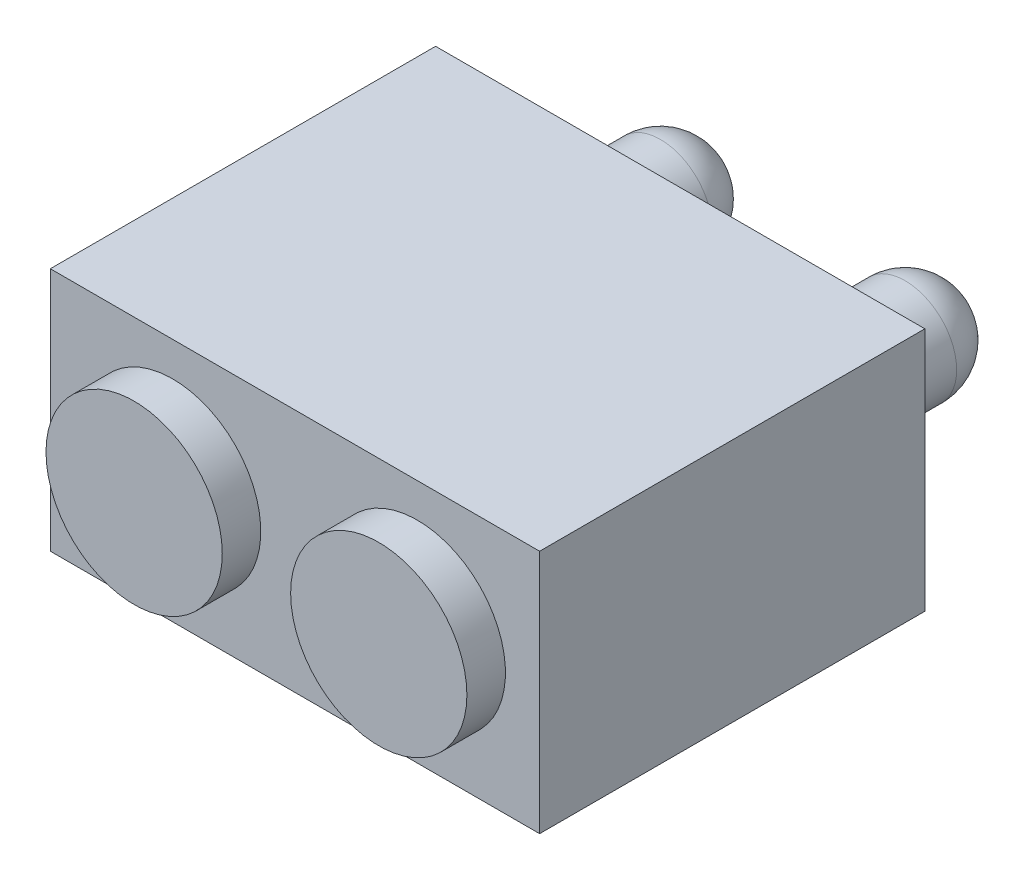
ISO-10303-21;
HEADER;
FILE_DESCRIPTION(('STEP AP214'),'2;1');
FILE_NAME('part.step','',(''),(''),'','','');
FILE_SCHEMA(('AUTOMOTIVE_DESIGN { 1 0 10303 214 1 1 1 1 }'));
ENDSEC;
DATA;
#1=APPLICATION_CONTEXT('core data for automotive mechanical design processes');
#2=APPLICATION_PROTOCOL_DEFINITION('international standard','automotive_design',2000,#1);
#3=PRODUCT_CONTEXT('',#1,'mechanical');
#4=PRODUCT('Part','Part','',(#3));
#5=PRODUCT_RELATED_PRODUCT_CATEGORY('part','',(#4));
#6=PRODUCT_DEFINITION_FORMATION('','',#4);
#7=PRODUCT_DEFINITION_CONTEXT('part definition',#1,'design');
#8=PRODUCT_DEFINITION('design','',#6,#7);
#9=PRODUCT_DEFINITION_SHAPE('','',#8);
#10=(LENGTH_UNIT() NAMED_UNIT(*) SI_UNIT(.MILLI.,.METRE.));
#11=(NAMED_UNIT(*) PLANE_ANGLE_UNIT() SI_UNIT($,.RADIAN.));
#12=(NAMED_UNIT(*) SI_UNIT($,.STERADIAN.) SOLID_ANGLE_UNIT());
#13=UNCERTAINTY_MEASURE_WITH_UNIT(LENGTH_MEASURE(1.E-05),#10,'distance_accuracy_value','');
#14=(GEOMETRIC_REPRESENTATION_CONTEXT(3) GLOBAL_UNCERTAINTY_ASSIGNED_CONTEXT((#13)) GLOBAL_UNIT_ASSIGNED_CONTEXT((#10,
#11,#12)) REPRESENTATION_CONTEXT('',''));
#15=CARTESIAN_POINT('',(0.,0.,0.));
#16=DIRECTION('',(0.,0.,1.));
#17=DIRECTION('',(1.,0.,0.));
#18=AXIS2_PLACEMENT_3D('',#15,#16,#17);
#19=CARTESIAN_POINT('',(0.,2.54,0.));
#20=DIRECTION('',(0.,0.,-1.));
#21=DIRECTION('',(-1.,0.,0.));
#22=AXIS2_PLACEMENT_3D('',#19,#20,#21);
#23=PLANE('',#22);
#24=CARTESIAN_POINT('',(3.81,1.27,0.));
#25=DIRECTION('',(0.,0.,-1.));
#26=DIRECTION('',(-1.,0.,0.));
#27=AXIS2_PLACEMENT_3D('',#24,#25,#26);
#28=CIRCLE('',#27,0.535);
#29=CARTESIAN_POINT('',(3.275,1.27,0.));
#30=VERTEX_POINT('',#29);
#31=EDGE_CURVE('E122',#30,#30,#28,.T.);
#32=ORIENTED_EDGE('',*,*,#31,.F.);
#33=EDGE_LOOP('',(#32));
#34=FACE_BOUND('',#33,.T.);
#35=DIRECTION('',(0.,-1.,0.));
#36=VECTOR('',#35,1.);
#37=CARTESIAN_POINT('',(0.,0.,0.));
#38=LINE('',#37,#36);
#39=CARTESIAN_POINT('',(0.,2.54,0.));
#40=VERTEX_POINT('',#39);
#41=CARTESIAN_POINT('',(0.,0.,0.));
#42=VERTEX_POINT('',#41);
#43=EDGE_CURVE('E82',#40,#42,#38,.T.);
#44=ORIENTED_EDGE('',*,*,#43,.F.);
#45=DIRECTION('',(-1.,0.,0.));
#46=VECTOR('',#45,1.);
#47=CARTESIAN_POINT('',(0.,2.54,0.));
#48=LINE('',#47,#46);
#49=CARTESIAN_POINT('',(5.08,2.54,0.));
#50=VERTEX_POINT('',#49);
#51=EDGE_CURVE('E107',#50,#40,#48,.T.);
#52=ORIENTED_EDGE('',*,*,#51,.F.);
#53=DIRECTION('',(0.,1.,0.));
#54=VECTOR('',#53,1.);
#55=CARTESIAN_POINT('',(5.08,0.,0.));
#56=LINE('',#55,#54);
#57=CARTESIAN_POINT('',(5.08,0.,0.));
#58=VERTEX_POINT('',#57);
#59=EDGE_CURVE('E83',#58,#50,#56,.T.);
#60=ORIENTED_EDGE('',*,*,#59,.F.);
#61=DIRECTION('',(1.,0.,0.));
#62=VECTOR('',#61,1.);
#63=CARTESIAN_POINT('',(0.,0.,0.));
#64=LINE('',#63,#62);
#65=EDGE_CURVE('E77',#42,#58,#64,.T.);
#66=ORIENTED_EDGE('',*,*,#65,.F.);
#67=EDGE_LOOP('',(#44,#52,#60,#66));
#68=FACE_BOUND('',#67,.T.);
#69=CARTESIAN_POINT('',(1.27,1.27,0.));
#70=DIRECTION('',(0.,0.,-1.));
#71=DIRECTION('',(-1.,0.,0.));
#72=AXIS2_PLACEMENT_3D('',#69,#70,#71);
#73=CIRCLE('',#72,0.535);
#74=CARTESIAN_POINT('',(0.735,1.27,0.));
#75=VERTEX_POINT('',#74);
#76=EDGE_CURVE('E131',#75,#75,#73,.T.);
#77=ORIENTED_EDGE('',*,*,#76,.F.);
#78=EDGE_LOOP('',(#77));
#79=FACE_BOUND('',#78,.T.);
#80=ADVANCED_FACE('F34',(#34,#68,#79),#23,.T.);
#81=CARTESIAN_POINT('',(0.,2.54,4.));
#82=DIRECTION('',(0.,0.,-1.));
#83=DIRECTION('',(-1.,0.,0.));
#84=AXIS2_PLACEMENT_3D('',#81,#82,#83);
#85=PLANE('',#84);
#86=CARTESIAN_POINT('',(3.81,1.27,4.));
#87=DIRECTION('',(0.,0.,-1.));
#88=DIRECTION('',(-1.,0.,0.));
#89=AXIS2_PLACEMENT_3D('',#86,#87,#88);
#90=CIRCLE('',#89,0.915);
#91=CARTESIAN_POINT('',(2.895,1.27,4.));
#92=VERTEX_POINT('',#91);
#93=EDGE_CURVE('E43',#92,#92,#90,.F.);
#94=ORIENTED_EDGE('',*,*,#93,.F.);
#95=EDGE_LOOP('',(#94));
#96=FACE_BOUND('',#95,.T.);
#97=DIRECTION('',(0.,-1.,0.));
#98=VECTOR('',#97,1.);
#99=CARTESIAN_POINT('',(0.,0.,4.));
#100=LINE('',#99,#98);
#101=CARTESIAN_POINT('',(0.,2.54,4.));
#102=VERTEX_POINT('',#101);
#103=CARTESIAN_POINT('',(0.,0.,4.));
#104=VERTEX_POINT('',#103);
#105=EDGE_CURVE('E109',#102,#104,#100,.T.);
#106=ORIENTED_EDGE('',*,*,#105,.T.);
#107=DIRECTION('',(1.,0.,0.));
#108=VECTOR('',#107,1.);
#109=CARTESIAN_POINT('',(0.,0.,4.));
#110=LINE('',#109,#108);
#111=CARTESIAN_POINT('',(5.08,0.,4.));
#112=VERTEX_POINT('',#111);
#113=EDGE_CURVE('E91',#104,#112,#110,.T.);
#114=ORIENTED_EDGE('',*,*,#113,.T.);
#115=DIRECTION('',(0.,1.,0.));
#116=VECTOR('',#115,1.);
#117=CARTESIAN_POINT('',(5.08,0.,4.));
#118=LINE('',#117,#116);
#119=CARTESIAN_POINT('',(5.08,2.54,4.));
#120=VERTEX_POINT('',#119);
#121=EDGE_CURVE('E56',#112,#120,#118,.T.);
#122=ORIENTED_EDGE('',*,*,#121,.T.);
#123=DIRECTION('',(-1.,0.,0.));
#124=VECTOR('',#123,1.);
#125=CARTESIAN_POINT('',(0.,2.54,4.));
#126=LINE('',#125,#124);
#127=EDGE_CURVE('E51',#120,#102,#126,.T.);
#128=ORIENTED_EDGE('',*,*,#127,.T.);
#129=EDGE_LOOP('',(#106,#114,#122,#128));
#130=FACE_BOUND('',#129,.T.);
#131=CARTESIAN_POINT('',(1.27,1.27,4.));
#132=DIRECTION('',(0.,0.,-1.));
#133=DIRECTION('',(-1.,0.,0.));
#134=AXIS2_PLACEMENT_3D('',#131,#132,#133);
#135=CIRCLE('',#134,0.915);
#136=CARTESIAN_POINT('',(0.355,1.27,4.));
#137=VERTEX_POINT('',#136);
#138=EDGE_CURVE('E11',#137,#137,#135,.F.);
#139=ORIENTED_EDGE('',*,*,#138,.F.);
#140=EDGE_LOOP('',(#139));
#141=FACE_BOUND('',#140,.T.);
#142=ADVANCED_FACE('F138',(#96,#130,#141),#85,.F.);
#143=CARTESIAN_POINT('',(0.,0.,4.));
#144=DIRECTION('',(1.,0.,0.));
#145=DIRECTION('',(0.,0.,-1.));
#146=AXIS2_PLACEMENT_3D('',#143,#144,#145);
#147=PLANE('',#146);
#148=ORIENTED_EDGE('',*,*,#43,.T.);
#149=DIRECTION('',(0.,0.,-1.));
#150=VECTOR('',#149,1.);
#151=CARTESIAN_POINT('',(0.,0.,4.));
#152=LINE('',#151,#150);
#153=EDGE_CURVE('E89',#104,#42,#152,.T.);
#154=ORIENTED_EDGE('',*,*,#153,.F.);
#155=ORIENTED_EDGE('',*,*,#105,.F.);
#156=DIRECTION('',(0.,0.,-1.));
#157=VECTOR('',#156,1.);
#158=CARTESIAN_POINT('',(0.,2.54,4.));
#159=LINE('',#158,#157);
#160=EDGE_CURVE('E98',#102,#40,#159,.T.);
#161=ORIENTED_EDGE('',*,*,#160,.T.);
#162=EDGE_LOOP('',(#148,#154,#155,#161));
#163=FACE_BOUND('',#162,.T.);
#164=ADVANCED_FACE('F97',(#163),#147,.F.);
#165=CARTESIAN_POINT('',(0.,0.,4.));
#166=DIRECTION('',(0.,1.,0.));
#167=DIRECTION('',(0.,0.,1.));
#168=AXIS2_PLACEMENT_3D('',#165,#166,#167);
#169=PLANE('',#168);
#170=ORIENTED_EDGE('',*,*,#65,.T.);
#171=DIRECTION('',(0.,0.,-1.));
#172=VECTOR('',#171,1.);
#173=CARTESIAN_POINT('',(5.08,0.,4.));
#174=LINE('',#173,#172);
#175=EDGE_CURVE('E94',#112,#58,#174,.T.);
#176=ORIENTED_EDGE('',*,*,#175,.F.);
#177=ORIENTED_EDGE('',*,*,#113,.F.);
#178=ORIENTED_EDGE('',*,*,#153,.T.);
#179=EDGE_LOOP('',(#170,#176,#177,#178));
#180=FACE_BOUND('',#179,.T.);
#181=ADVANCED_FACE('F90',(#180),#169,.F.);
#182=CARTESIAN_POINT('',(5.08,0.,4.));
#183=DIRECTION('',(-1.,0.,0.));
#184=DIRECTION('',(0.,0.,1.));
#185=AXIS2_PLACEMENT_3D('',#182,#183,#184);
#186=PLANE('',#185);
#187=ORIENTED_EDGE('',*,*,#59,.T.);
#188=DIRECTION('',(0.,0.,-1.));
#189=VECTOR('',#188,1.);
#190=CARTESIAN_POINT('',(5.08,2.54,4.));
#191=LINE('',#190,#189);
#192=EDGE_CURVE('E115',#120,#50,#191,.T.);
#193=ORIENTED_EDGE('',*,*,#192,.F.);
#194=ORIENTED_EDGE('',*,*,#121,.F.);
#195=ORIENTED_EDGE('',*,*,#175,.T.);
#196=EDGE_LOOP('',(#187,#193,#194,#195));
#197=FACE_BOUND('',#196,.T.);
#198=ADVANCED_FACE('F153',(#197),#186,.F.);
#199=CARTESIAN_POINT('',(0.,2.54,4.));
#200=DIRECTION('',(0.,-1.,0.));
#201=DIRECTION('',(0.,0.,-1.));
#202=AXIS2_PLACEMENT_3D('',#199,#200,#201);
#203=PLANE('',#202);
#204=ORIENTED_EDGE('',*,*,#51,.T.);
#205=ORIENTED_EDGE('',*,*,#160,.F.);
#206=ORIENTED_EDGE('',*,*,#127,.F.);
#207=ORIENTED_EDGE('',*,*,#192,.T.);
#208=EDGE_LOOP('',(#204,#205,#206,#207));
#209=FACE_BOUND('',#208,.T.);
#210=ADVANCED_FACE('F150',(#209),#203,.F.);
#211=CARTESIAN_POINT('',(3.81,1.27,4.4));
#212=DIRECTION('',(0.,0.,-1.));
#213=DIRECTION('',(-1.,0.,0.));
#214=AXIS2_PLACEMENT_3D('',#211,#212,#213);
#215=CYLINDRICAL_SURFACE('',#214,0.915);
#216=CARTESIAN_POINT('',(3.81,1.27,4.4));
#217=DIRECTION('',(0.,0.,1.));
#218=DIRECTION('',(1.,0.,0.));
#219=AXIS2_PLACEMENT_3D('',#216,#217,#218);
#220=CIRCLE('',#219,0.915);
#221=CARTESIAN_POINT('',(4.725,1.27,4.4));
#222=VERTEX_POINT('',#221);
#223=EDGE_CURVE('E99',#222,#222,#220,.T.);
#224=ORIENTED_EDGE('',*,*,#223,.F.);
#225=EDGE_LOOP('',(#224));
#226=FACE_BOUND('',#225,.T.);
#227=ORIENTED_EDGE('',*,*,#93,.T.);
#228=EDGE_LOOP('',(#227));
#229=FACE_BOUND('',#228,.T.);
#230=ADVANCED_FACE('F147',(#226,#229),#215,.T.);
#231=CARTESIAN_POINT('',(3.81,1.27,4.4));
#232=DIRECTION('',(0.,0.,1.));
#233=DIRECTION('',(1.,0.,0.));
#234=AXIS2_PLACEMENT_3D('',#231,#232,#233);
#235=PLANE('',#234);
#236=ORIENTED_EDGE('',*,*,#223,.T.);
#237=EDGE_LOOP('',(#236));
#238=FACE_BOUND('',#237,.T.);
#239=ADVANCED_FACE('F181',(#238),#235,.T.);
#240=CARTESIAN_POINT('',(1.27,1.27,4.4));
#241=DIRECTION('',(0.,0.,-1.));
#242=DIRECTION('',(-1.,0.,0.));
#243=AXIS2_PLACEMENT_3D('',#240,#241,#242);
#244=CYLINDRICAL_SURFACE('',#243,0.915);
#245=CARTESIAN_POINT('',(1.27,1.27,4.4));
#246=DIRECTION('',(0.,0.,1.));
#247=DIRECTION('',(1.,0.,0.));
#248=AXIS2_PLACEMENT_3D('',#245,#246,#247);
#249=CIRCLE('',#248,0.915);
#250=CARTESIAN_POINT('',(2.185,1.27,4.4));
#251=VERTEX_POINT('',#250);
#252=EDGE_CURVE('E102',#251,#251,#249,.T.);
#253=ORIENTED_EDGE('',*,*,#252,.F.);
#254=EDGE_LOOP('',(#253));
#255=FACE_BOUND('',#254,.T.);
#256=ORIENTED_EDGE('',*,*,#138,.T.);
#257=EDGE_LOOP('',(#256));
#258=FACE_BOUND('',#257,.T.);
#259=ADVANCED_FACE('F176',(#255,#258),#244,.T.);
#260=CARTESIAN_POINT('',(1.27,1.27,4.4));
#261=DIRECTION('',(0.,0.,1.));
#262=DIRECTION('',(1.,0.,0.));
#263=AXIS2_PLACEMENT_3D('',#260,#261,#262);
#264=PLANE('',#263);
#265=ORIENTED_EDGE('',*,*,#252,.T.);
#266=EDGE_LOOP('',(#265));
#267=FACE_BOUND('',#266,.T.);
#268=ADVANCED_FACE('F170',(#267),#264,.T.);
#269=CARTESIAN_POINT('',(3.81,1.27,-1.065));
#270=DIRECTION('',(0.,0.,1.));
#271=DIRECTION('',(1.,0.,0.));
#272=AXIS2_PLACEMENT_3D('',#269,#270,#271);
#273=CYLINDRICAL_SURFACE('',#272,0.535);
#274=CARTESIAN_POINT('',(3.81,1.27,-1.065));
#275=DIRECTION('',(0.,0.,-1.));
#276=DIRECTION('',(-1.,0.,0.));
#277=AXIS2_PLACEMENT_3D('',#274,#275,#276);
#278=CIRCLE('',#277,0.535);
#279=CARTESIAN_POINT('',(3.275,1.27,-1.065));
#280=VERTEX_POINT('',#279);
#281=EDGE_CURVE('E120',#280,#280,#278,.T.);
#282=ORIENTED_EDGE('',*,*,#281,.F.);
#283=EDGE_LOOP('',(#282));
#284=FACE_BOUND('',#283,.T.);
#285=ORIENTED_EDGE('',*,*,#31,.T.);
#286=EDGE_LOOP('',(#285));
#287=FACE_BOUND('',#286,.T.);
#288=ADVANCED_FACE('F163',(#284,#287),#273,.T.);
#289=CARTESIAN_POINT('',(3.81,1.27,-1.065));
#290=DIRECTION('',(0.,0.,1.));
#291=DIRECTION('',(1.,0.,0.));
#292=AXIS2_PLACEMENT_3D('',#289,#290,#291);
#293=SPHERICAL_SURFACE('',#292,0.535);
#294=ORIENTED_EDGE('',*,*,#281,.T.);
#295=EDGE_LOOP('',(#294));
#296=FACE_BOUND('',#295,.T.);
#297=ADVANCED_FACE('F161',(#296),#293,.T.);
#298=CARTESIAN_POINT('',(1.27,1.27,-1.065));
#299=DIRECTION('',(0.,0.,1.));
#300=DIRECTION('',(1.,0.,0.));
#301=AXIS2_PLACEMENT_3D('',#298,#299,#300);
#302=CYLINDRICAL_SURFACE('',#301,0.535);
#303=CARTESIAN_POINT('',(1.27,1.27,-1.065));
#304=DIRECTION('',(0.,0.,-1.));
#305=DIRECTION('',(-1.,0.,0.));
#306=AXIS2_PLACEMENT_3D('',#303,#304,#305);
#307=CIRCLE('',#306,0.535);
#308=CARTESIAN_POINT('',(0.735,1.27,-1.065));
#309=VERTEX_POINT('',#308);
#310=EDGE_CURVE('E38',#309,#309,#307,.T.);
#311=ORIENTED_EDGE('',*,*,#310,.F.);
#312=EDGE_LOOP('',(#311));
#313=FACE_BOUND('',#312,.T.);
#314=ORIENTED_EDGE('',*,*,#76,.T.);
#315=EDGE_LOOP('',(#314));
#316=FACE_BOUND('',#315,.T.);
#317=ADVANCED_FACE('F136',(#313,#316),#302,.T.);
#318=CARTESIAN_POINT('',(1.27,1.27,-1.065));
#319=DIRECTION('',(0.,0.,1.));
#320=DIRECTION('',(1.,0.,0.));
#321=AXIS2_PLACEMENT_3D('',#318,#319,#320);
#322=SPHERICAL_SURFACE('',#321,0.535);
#323=ORIENTED_EDGE('',*,*,#310,.T.);
#324=EDGE_LOOP('',(#323));
#325=FACE_BOUND('',#324,.T.);
#326=ADVANCED_FACE('F36',(#325),#322,.T.);
#327=CLOSED_SHELL('',(#80,#142,#164,#181,#198,#210,#230,#239,#259,#268,#288,#297,#317,#326));
#328=MANIFOLD_SOLID_BREP('B2',#327);
#329=ADVANCED_BREP_SHAPE_REPRESENTATION('',(#18,#328),#14);
#330=SHAPE_DEFINITION_REPRESENTATION(#9,#329);
ENDSEC;
END-ISO-10303-21;
